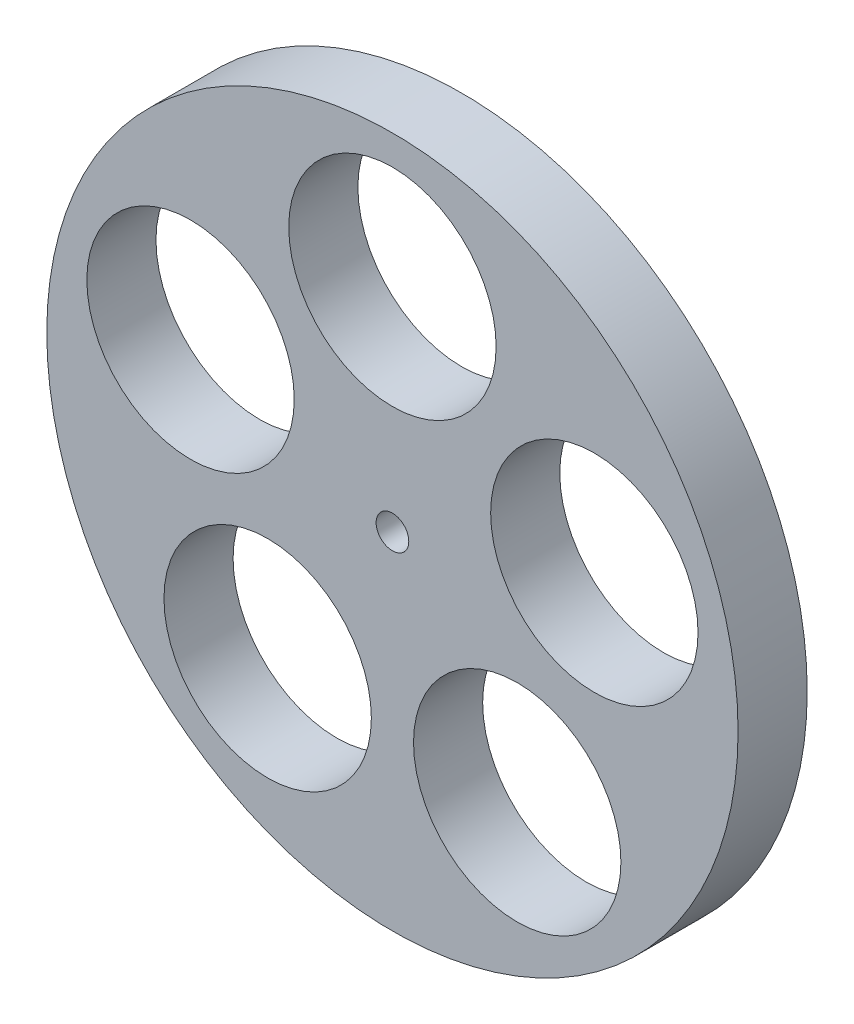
from build123d import *

# Parameters (mm, degrees)
SKETCH1_R           = 63.5
SKETCH1_R_2         = 3
SKETCH1_R_3         = 19.05
BOSS_EXTRUDE1_DEPTH = 12.7


with BuildPart() as part:
    # Sketch1 → Boss-Extrude1 (new body)
    with BuildSketch(Plane.XY):
        Circle(SKETCH1_R)
        Circle(SKETCH1_R_2, mode=Mode.SUBTRACT)
        with Locations((0, 39)):
            Circle(SKETCH1_R_3, mode=Mode.SUBTRACT)
        with Locations((37.091204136, 12.051662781)):
            Circle(SKETCH1_R_3, mode=Mode.SUBTRACT)
        with Locations((22.923624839, -31.551662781)):
            Circle(SKETCH1_R_3, mode=Mode.SUBTRACT)
        with Locations((-22.923624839, -31.551662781)):
            Circle(SKETCH1_R_3, mode=Mode.SUBTRACT)
        with Locations((-37.091204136, 12.051662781)):
            Circle(SKETCH1_R_3, mode=Mode.SUBTRACT)
    extrude(amount=BOSS_EXTRUDE1_DEPTH)


solid = part.part
